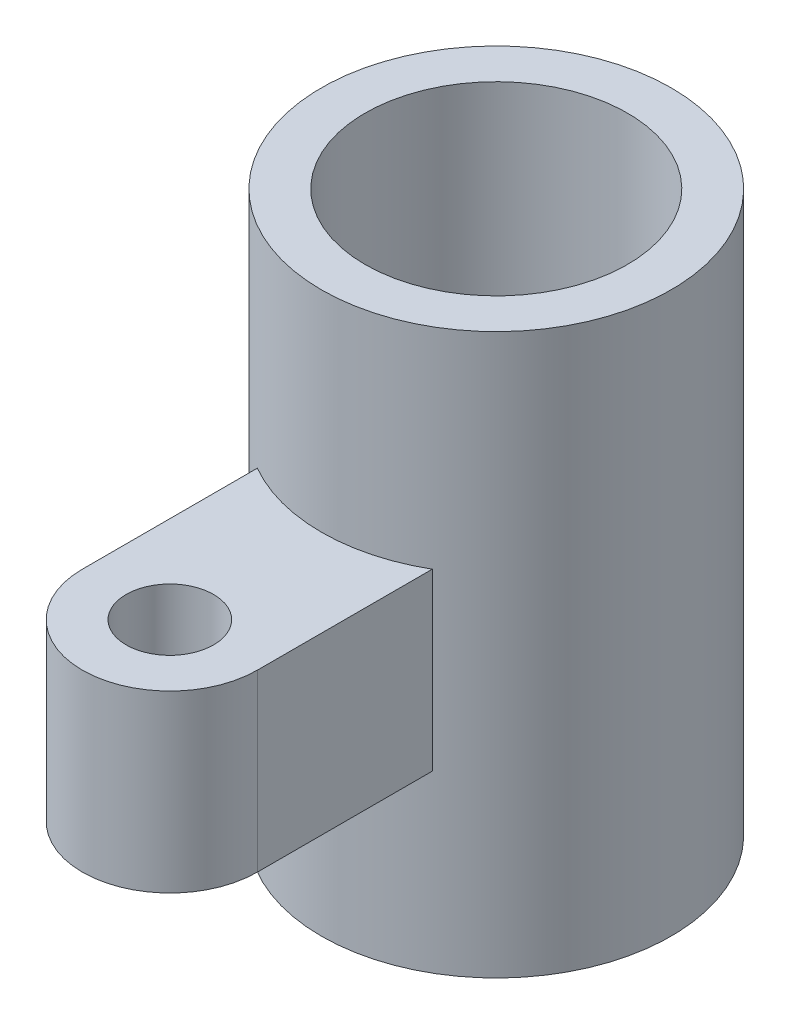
ISO-10303-21;
HEADER;
FILE_DESCRIPTION(('STEP AP214'),'2;1');
FILE_NAME('part.step','',(''),(''),'','','');
FILE_SCHEMA(('AUTOMOTIVE_DESIGN { 1 0 10303 214 1 1 1 1 }'));
ENDSEC;
DATA;
#1=APPLICATION_CONTEXT('core data for automotive mechanical design processes');
#2=APPLICATION_PROTOCOL_DEFINITION('international standard','automotive_design',2000,#1);
#3=PRODUCT_CONTEXT('',#1,'mechanical');
#4=PRODUCT('Part','Part','',(#3));
#5=PRODUCT_RELATED_PRODUCT_CATEGORY('part','',(#4));
#6=PRODUCT_DEFINITION_FORMATION('','',#4);
#7=PRODUCT_DEFINITION_CONTEXT('part definition',#1,'design');
#8=PRODUCT_DEFINITION('design','',#6,#7);
#9=PRODUCT_DEFINITION_SHAPE('','',#8);
#10=(LENGTH_UNIT() NAMED_UNIT(*) SI_UNIT(.MILLI.,.METRE.));
#11=(NAMED_UNIT(*) PLANE_ANGLE_UNIT() SI_UNIT($,.RADIAN.));
#12=(NAMED_UNIT(*) SI_UNIT($,.STERADIAN.) SOLID_ANGLE_UNIT());
#13=UNCERTAINTY_MEASURE_WITH_UNIT(LENGTH_MEASURE(1.E-05),#10,'distance_accuracy_value','');
#14=(GEOMETRIC_REPRESENTATION_CONTEXT(3) GLOBAL_UNCERTAINTY_ASSIGNED_CONTEXT((#13)) GLOBAL_UNIT_ASSIGNED_CONTEXT((#10,
#11,#12)) REPRESENTATION_CONTEXT('',''));
#15=CARTESIAN_POINT('',(0.,0.,0.));
#16=DIRECTION('',(0.,0.,1.));
#17=DIRECTION('',(1.,0.,0.));
#18=AXIS2_PLACEMENT_3D('',#15,#16,#17);
#19=CARTESIAN_POINT('',(0.,64.,0.));
#20=DIRECTION('',(0.,-1.,0.));
#21=DIRECTION('',(0.,0.,-1.));
#22=AXIS2_PLACEMENT_3D('',#19,#20,#21);
#23=CYLINDRICAL_SURFACE('',#22,20.);
#24=CARTESIAN_POINT('',(0.,0.,0.));
#25=DIRECTION('',(0.,1.,0.));
#26=DIRECTION('',(0.,0.,1.));
#27=AXIS2_PLACEMENT_3D('',#24,#25,#26);
#28=CIRCLE('',#27,20.);
#29=CARTESIAN_POINT('',(0.,0.,20.));
#30=VERTEX_POINT('',#29);
#31=EDGE_CURVE('E103',#30,#30,#28,.T.);
#32=ORIENTED_EDGE('',*,*,#31,.T.);
#33=EDGE_LOOP('',(#32));
#34=FACE_BOUND('',#33,.T.);
#35=CARTESIAN_POINT('',(0.,64.,0.));
#36=DIRECTION('',(0.,1.,0.));
#37=DIRECTION('',(0.,0.,1.));
#38=AXIS2_PLACEMENT_3D('',#35,#36,#37);
#39=CIRCLE('',#38,20.);
#40=CARTESIAN_POINT('',(0.,64.,20.));
#41=VERTEX_POINT('',#40);
#42=EDGE_CURVE('E105',#41,#41,#39,.T.);
#43=ORIENTED_EDGE('',*,*,#42,.F.);
#44=EDGE_LOOP('',(#43));
#45=FACE_BOUND('',#44,.T.);
#46=DIRECTION('',(0.,-1.,0.));
#47=VECTOR('',#46,1.);
#48=CARTESIAN_POINT('',(-10.,40.,17.3205080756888));
#49=LINE('',#48,#47);
#50=CARTESIAN_POINT('',(-10.,40.,17.3205080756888));
#51=VERTEX_POINT('',#50);
#52=CARTESIAN_POINT('',(-10.,20.,17.3205080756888));
#53=VERTEX_POINT('',#52);
#54=EDGE_CURVE('E47',#51,#53,#49,.T.);
#55=ORIENTED_EDGE('',*,*,#54,.F.);
#56=CARTESIAN_POINT('',(0.,40.,0.));
#57=DIRECTION('',(0.,1.,0.));
#58=DIRECTION('',(0.,0.,1.));
#59=AXIS2_PLACEMENT_3D('',#56,#57,#58);
#60=CIRCLE('',#59,20.);
#61=CARTESIAN_POINT('',(10.,40.,17.3205080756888));
#62=VERTEX_POINT('',#61);
#63=EDGE_CURVE('E11',#51,#62,#60,.T.);
#64=ORIENTED_EDGE('',*,*,#63,.T.);
#65=DIRECTION('',(0.,-1.,0.));
#66=VECTOR('',#65,1.);
#67=CARTESIAN_POINT('',(10.,40.,17.3205080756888));
#68=LINE('',#67,#66);
#69=CARTESIAN_POINT('',(10.,20.,17.3205080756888));
#70=VERTEX_POINT('',#69);
#71=EDGE_CURVE('E98',#62,#70,#68,.T.);
#72=ORIENTED_EDGE('',*,*,#71,.T.);
#73=CARTESIAN_POINT('',(0.,20.,0.));
#74=DIRECTION('',(0.,1.,0.));
#75=DIRECTION('',(0.,0.,1.));
#76=AXIS2_PLACEMENT_3D('',#73,#74,#75);
#77=CIRCLE('',#76,20.);
#78=EDGE_CURVE('E41',#53,#70,#77,.T.);
#79=ORIENTED_EDGE('',*,*,#78,.F.);
#80=EDGE_LOOP('',(#55,#64,#72,#79));
#81=FACE_BOUND('',#80,.T.);
#82=ADVANCED_FACE('F34',(#34,#45,#81),#23,.T.);
#83=CARTESIAN_POINT('',(0.,64.,0.));
#84=DIRECTION('',(0.,1.,0.));
#85=DIRECTION('',(0.,0.,1.));
#86=AXIS2_PLACEMENT_3D('',#83,#84,#85);
#87=PLANE('',#86);
#88=ORIENTED_EDGE('',*,*,#42,.T.);
#89=EDGE_LOOP('',(#88));
#90=FACE_BOUND('',#89,.T.);
#91=CARTESIAN_POINT('',(0.,64.,0.));
#92=DIRECTION('',(0.,1.,0.));
#93=DIRECTION('',(0.,0.,1.));
#94=AXIS2_PLACEMENT_3D('',#91,#92,#93);
#95=CIRCLE('',#94,15.);
#96=CARTESIAN_POINT('',(0.,64.,15.));
#97=VERTEX_POINT('',#96);
#98=EDGE_CURVE('E96',#97,#97,#95,.T.);
#99=ORIENTED_EDGE('',*,*,#98,.F.);
#100=EDGE_LOOP('',(#99));
#101=FACE_BOUND('',#100,.T.);
#102=ADVANCED_FACE('F142',(#90,#101),#87,.T.);
#103=CARTESIAN_POINT('',(0.,0.,0.));
#104=DIRECTION('',(0.,1.,0.));
#105=DIRECTION('',(0.,0.,1.));
#106=AXIS2_PLACEMENT_3D('',#103,#104,#105);
#107=PLANE('',#106);
#108=ORIENTED_EDGE('',*,*,#31,.F.);
#109=EDGE_LOOP('',(#108));
#110=FACE_BOUND('',#109,.T.);
#111=CARTESIAN_POINT('',(0.,0.,0.));
#112=DIRECTION('',(0.,1.,0.));
#113=DIRECTION('',(0.,0.,1.));
#114=AXIS2_PLACEMENT_3D('',#111,#112,#113);
#115=CIRCLE('',#114,15.);
#116=CARTESIAN_POINT('',(0.,0.,15.));
#117=VERTEX_POINT('',#116);
#118=EDGE_CURVE('E93',#117,#117,#115,.T.);
#119=ORIENTED_EDGE('',*,*,#118,.T.);
#120=EDGE_LOOP('',(#119));
#121=FACE_BOUND('',#120,.T.);
#122=ADVANCED_FACE('F147',(#110,#121),#107,.F.);
#123=CARTESIAN_POINT('',(0.,64.,0.));
#124=DIRECTION('',(0.,-1.,0.));
#125=DIRECTION('',(0.,0.,-1.));
#126=AXIS2_PLACEMENT_3D('',#123,#124,#125);
#127=CYLINDRICAL_SURFACE('',#126,15.);
#128=ORIENTED_EDGE('',*,*,#98,.T.);
#129=EDGE_LOOP('',(#128));
#130=FACE_BOUND('',#129,.T.);
#131=ORIENTED_EDGE('',*,*,#118,.F.);
#132=EDGE_LOOP('',(#131));
#133=FACE_BOUND('',#132,.T.);
#134=ADVANCED_FACE('F156',(#130,#133),#127,.F.);
#135=CARTESIAN_POINT('',(0.,40.,37.3205080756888));
#136=DIRECTION('',(0.,1.,0.));
#137=DIRECTION('',(0.,0.,1.));
#138=AXIS2_PLACEMENT_3D('',#135,#136,#137);
#139=PLANE('',#138);
#140=ORIENTED_EDGE('',*,*,#63,.F.);
#141=DIRECTION('',(0.,0.,1.));
#142=VECTOR('',#141,1.);
#143=CARTESIAN_POINT('',(-10.,40.,17.3205080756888));
#144=LINE('',#143,#142);
#145=CARTESIAN_POINT('',(-10.,40.,37.3205080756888));
#146=VERTEX_POINT('',#145);
#147=EDGE_CURVE('E82',#51,#146,#144,.T.);
#148=ORIENTED_EDGE('',*,*,#147,.T.);
#149=CARTESIAN_POINT('',(0.,40.,37.3205080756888));
#150=DIRECTION('',(0.,1.,0.));
#151=DIRECTION('',(0.,0.,1.));
#152=AXIS2_PLACEMENT_3D('',#149,#150,#151);
#153=CIRCLE('',#152,10.);
#154=CARTESIAN_POINT('',(10.,40.,37.3205080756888));
#155=VERTEX_POINT('',#154);
#156=EDGE_CURVE('E70',#146,#155,#153,.T.);
#157=ORIENTED_EDGE('',*,*,#156,.T.);
#158=DIRECTION('',(0.,0.,-1.));
#159=VECTOR('',#158,1.);
#160=CARTESIAN_POINT('',(10.,40.,17.3205080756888));
#161=LINE('',#160,#159);
#162=EDGE_CURVE('E81',#155,#62,#161,.T.);
#163=ORIENTED_EDGE('',*,*,#162,.T.);
#164=EDGE_LOOP('',(#140,#148,#157,#163));
#165=FACE_BOUND('',#164,.T.);
#166=CARTESIAN_POINT('',(0.,40.,37.3205080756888));
#167=DIRECTION('',(0.,1.,0.));
#168=DIRECTION('',(0.,0.,1.));
#169=AXIS2_PLACEMENT_3D('',#166,#167,#168);
#170=CIRCLE('',#169,5.);
#171=CARTESIAN_POINT('',(0.,40.,42.3205080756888));
#172=VERTEX_POINT('',#171);
#173=EDGE_CURVE('E123',#172,#172,#170,.T.);
#174=ORIENTED_EDGE('',*,*,#173,.F.);
#175=EDGE_LOOP('',(#174));
#176=FACE_BOUND('',#175,.T.);
#177=ADVANCED_FACE('F85',(#165,#176),#139,.T.);
#178=CARTESIAN_POINT('',(0.,20.,37.3205080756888));
#179=DIRECTION('',(0.,1.,0.));
#180=DIRECTION('',(0.,0.,1.));
#181=AXIS2_PLACEMENT_3D('',#178,#179,#180);
#182=PLANE('',#181);
#183=DIRECTION('',(0.,0.,1.));
#184=VECTOR('',#183,1.);
#185=CARTESIAN_POINT('',(-10.,20.,17.3205080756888));
#186=LINE('',#185,#184);
#187=CARTESIAN_POINT('',(-10.,20.,37.3205080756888));
#188=VERTEX_POINT('',#187);
#189=EDGE_CURVE('E92',#53,#188,#186,.T.);
#190=ORIENTED_EDGE('',*,*,#189,.F.);
#191=ORIENTED_EDGE('',*,*,#78,.T.);
#192=DIRECTION('',(0.,0.,-1.));
#193=VECTOR('',#192,1.);
#194=CARTESIAN_POINT('',(10.,20.,17.3205080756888));
#195=LINE('',#194,#193);
#196=CARTESIAN_POINT('',(10.,20.,37.3205080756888));
#197=VERTEX_POINT('',#196);
#198=EDGE_CURVE('E88',#197,#70,#195,.T.);
#199=ORIENTED_EDGE('',*,*,#198,.F.);
#200=CARTESIAN_POINT('',(0.,20.,37.3205080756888));
#201=DIRECTION('',(0.,1.,0.));
#202=DIRECTION('',(0.,0.,1.));
#203=AXIS2_PLACEMENT_3D('',#200,#201,#202);
#204=CIRCLE('',#203,10.);
#205=EDGE_CURVE('E117',#188,#197,#204,.T.);
#206=ORIENTED_EDGE('',*,*,#205,.F.);
#207=EDGE_LOOP('',(#190,#191,#199,#206));
#208=FACE_BOUND('',#207,.T.);
#209=CARTESIAN_POINT('',(0.,20.,37.3205080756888));
#210=DIRECTION('',(0.,1.,0.));
#211=DIRECTION('',(0.,0.,1.));
#212=AXIS2_PLACEMENT_3D('',#209,#210,#211);
#213=CIRCLE('',#212,5.);
#214=CARTESIAN_POINT('',(0.,20.,42.3205080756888));
#215=VERTEX_POINT('',#214);
#216=EDGE_CURVE('E125',#215,#215,#213,.T.);
#217=ORIENTED_EDGE('',*,*,#216,.T.);
#218=EDGE_LOOP('',(#217));
#219=FACE_BOUND('',#218,.T.);
#220=ADVANCED_FACE('F112',(#208,#219),#182,.F.);
#221=CARTESIAN_POINT('',(-10.,40.,17.3205080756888));
#222=DIRECTION('',(1.,0.,0.));
#223=DIRECTION('',(0.,0.,-1.));
#224=AXIS2_PLACEMENT_3D('',#221,#222,#223);
#225=PLANE('',#224);
#226=ORIENTED_EDGE('',*,*,#189,.T.);
#227=DIRECTION('',(0.,-1.,0.));
#228=VECTOR('',#227,1.);
#229=CARTESIAN_POINT('',(-10.,40.,37.3205080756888));
#230=LINE('',#229,#228);
#231=EDGE_CURVE('E74',#146,#188,#230,.T.);
#232=ORIENTED_EDGE('',*,*,#231,.F.);
#233=ORIENTED_EDGE('',*,*,#147,.F.);
#234=ORIENTED_EDGE('',*,*,#54,.T.);
#235=EDGE_LOOP('',(#226,#232,#233,#234));
#236=FACE_BOUND('',#235,.T.);
#237=ADVANCED_FACE('F90',(#236),#225,.F.);
#238=CARTESIAN_POINT('',(0.,40.,37.3205080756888));
#239=DIRECTION('',(0.,-1.,0.));
#240=DIRECTION('',(0.,0.,-1.));
#241=AXIS2_PLACEMENT_3D('',#238,#239,#240);
#242=CYLINDRICAL_SURFACE('',#241,10.);
#243=ORIENTED_EDGE('',*,*,#205,.T.);
#244=DIRECTION('',(0.,-1.,0.));
#245=VECTOR('',#244,1.);
#246=CARTESIAN_POINT('',(10.,40.,37.3205080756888));
#247=LINE('',#246,#245);
#248=EDGE_CURVE('E77',#155,#197,#247,.T.);
#249=ORIENTED_EDGE('',*,*,#248,.F.);
#250=ORIENTED_EDGE('',*,*,#156,.F.);
#251=ORIENTED_EDGE('',*,*,#231,.T.);
#252=EDGE_LOOP('',(#243,#249,#250,#251));
#253=FACE_BOUND('',#252,.T.);
#254=ADVANCED_FACE('F72',(#253),#242,.T.);
#255=CARTESIAN_POINT('',(10.,40.,17.3205080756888));
#256=DIRECTION('',(-1.,0.,0.));
#257=DIRECTION('',(0.,0.,1.));
#258=AXIS2_PLACEMENT_3D('',#255,#256,#257);
#259=PLANE('',#258);
#260=ORIENTED_EDGE('',*,*,#198,.T.);
#261=ORIENTED_EDGE('',*,*,#71,.F.);
#262=ORIENTED_EDGE('',*,*,#162,.F.);
#263=ORIENTED_EDGE('',*,*,#248,.T.);
#264=EDGE_LOOP('',(#260,#261,#262,#263));
#265=FACE_BOUND('',#264,.T.);
#266=ADVANCED_FACE('F116',(#265),#259,.F.);
#267=CARTESIAN_POINT('',(0.,40.,37.3205080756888));
#268=DIRECTION('',(0.,-1.,0.));
#269=DIRECTION('',(0.,0.,-1.));
#270=AXIS2_PLACEMENT_3D('',#267,#268,#269);
#271=CYLINDRICAL_SURFACE('',#270,5.);
#272=ORIENTED_EDGE('',*,*,#173,.T.);
#273=EDGE_LOOP('',(#272));
#274=FACE_BOUND('',#273,.T.);
#275=ORIENTED_EDGE('',*,*,#216,.F.);
#276=EDGE_LOOP('',(#275));
#277=FACE_BOUND('',#276,.T.);
#278=ADVANCED_FACE('F133',(#274,#277),#271,.F.);
#279=CLOSED_SHELL('',(#82,#102,#122,#134,#177,#220,#237,#254,#266,#278));
#280=MANIFOLD_SOLID_BREP('B2',#279);
#281=ADVANCED_BREP_SHAPE_REPRESENTATION('',(#18,#280),#14);
#282=SHAPE_DEFINITION_REPRESENTATION(#9,#281);
ENDSEC;
END-ISO-10303-21;
